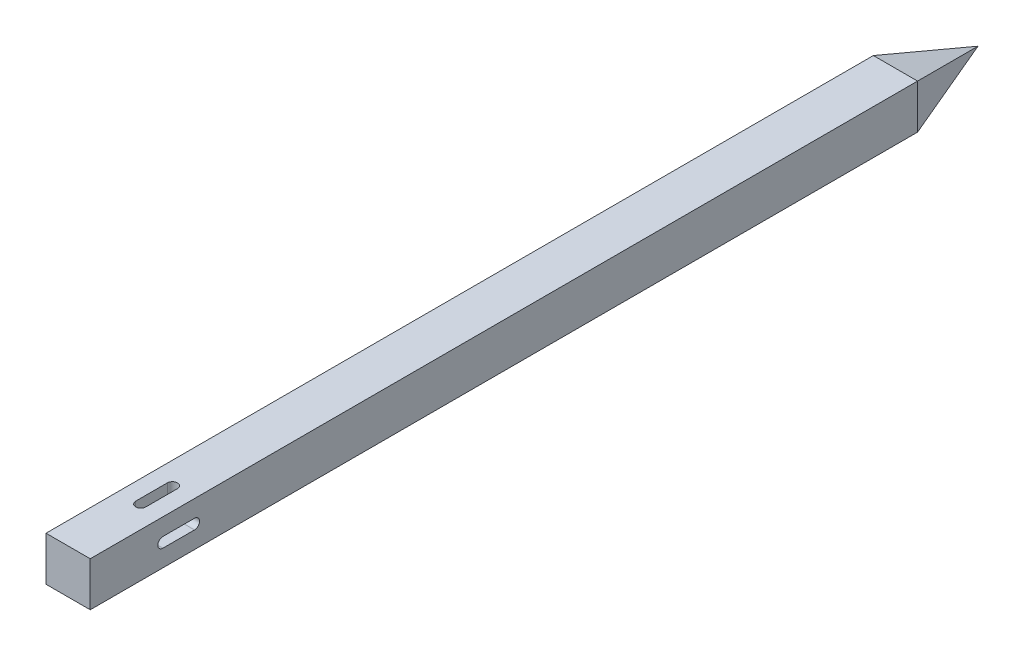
ISO-10303-21;
HEADER;
FILE_DESCRIPTION(('STEP AP214'),'2;1');
FILE_NAME('part.step','',(''),(''),'','','');
FILE_SCHEMA(('AUTOMOTIVE_DESIGN { 1 0 10303 214 1 1 1 1 }'));
ENDSEC;
DATA;
#1=APPLICATION_CONTEXT('core data for automotive mechanical design processes');
#2=APPLICATION_PROTOCOL_DEFINITION('international standard','automotive_design',2000,#1);
#3=PRODUCT_CONTEXT('',#1,'mechanical');
#4=PRODUCT('Part','Part','',(#3));
#5=PRODUCT_RELATED_PRODUCT_CATEGORY('part','',(#4));
#6=PRODUCT_DEFINITION_FORMATION('','',#4);
#7=PRODUCT_DEFINITION_CONTEXT('part definition',#1,'design');
#8=PRODUCT_DEFINITION('design','',#6,#7);
#9=PRODUCT_DEFINITION_SHAPE('','',#8);
#10=(LENGTH_UNIT() NAMED_UNIT(*) SI_UNIT(.MILLI.,.METRE.));
#11=(NAMED_UNIT(*) PLANE_ANGLE_UNIT() SI_UNIT($,.RADIAN.));
#12=(NAMED_UNIT(*) SI_UNIT($,.STERADIAN.) SOLID_ANGLE_UNIT());
#13=UNCERTAINTY_MEASURE_WITH_UNIT(LENGTH_MEASURE(1.E-05),#10,'distance_accuracy_value','');
#14=(GEOMETRIC_REPRESENTATION_CONTEXT(3) GLOBAL_UNCERTAINTY_ASSIGNED_CONTEXT((#13)) GLOBAL_UNIT_ASSIGNED_CONTEXT((#10,
#11,#12)) REPRESENTATION_CONTEXT('',''));
#15=CARTESIAN_POINT('',(0.,0.,0.));
#16=DIRECTION('',(0.,0.,1.));
#17=DIRECTION('',(1.,0.,0.));
#18=AXIS2_PLACEMENT_3D('',#15,#16,#17);
#19=CARTESIAN_POINT('',(-17.5000000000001,0.,487.5));
#20=DIRECTION('',(1.,0.,0.));
#21=DIRECTION('',(0.,1.,0.));
#22=AXIS2_PLACEMENT_3D('',#19,#20,#21);
#23=CYLINDRICAL_SURFACE('',#22,4.);
#24=CARTESIAN_POINT('',(0.,0.,487.5));
#25=DIRECTION('',(0.707106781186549,-0.707106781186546,0.));
#26=DIRECTION('',(0.707106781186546,0.707106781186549,0.));
#27=AXIS2_PLACEMENT_3D('',#24,#25,#26);
#28=ELLIPSE('',#27,5.65685424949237,4.);
#29=CARTESIAN_POINT('',(3.99999999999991,4.00000000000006,487.5));
#30=VERTEX_POINT('',#29);
#31=CARTESIAN_POINT('',(0.,0.,483.5));
#32=VERTEX_POINT('',#31);
#33=EDGE_CURVE('E225',#30,#32,#28,.F.);
#34=ORIENTED_EDGE('',*,*,#33,.T.);
#35=CARTESIAN_POINT('',(0.,0.,487.5));
#36=DIRECTION('',(0.707106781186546,0.707106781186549,0.));
#37=DIRECTION('',(0.707106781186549,-0.707106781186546,0.));
#38=AXIS2_PLACEMENT_3D('',#35,#36,#37);
#39=ELLIPSE('',#38,5.65685424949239,4.);
#40=CARTESIAN_POINT('',(3.99999999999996,-3.99999999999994,487.5));
#41=VERTEX_POINT('',#40);
#42=EDGE_CURVE('E234',#32,#41,#39,.F.);
#43=ORIENTED_EDGE('',*,*,#42,.T.);
#44=DIRECTION('',(1.,0.,0.));
#45=VECTOR('',#44,1.);
#46=CARTESIAN_POINT('',(-17.5000000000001,-3.99999999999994,487.5));
#47=LINE('',#46,#45);
#48=CARTESIAN_POINT('',(17.5,-3.99999999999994,487.5));
#49=VERTEX_POINT('',#48);
#50=EDGE_CURVE('E266',#41,#49,#47,.T.);
#51=ORIENTED_EDGE('',*,*,#50,.T.);
#52=CARTESIAN_POINT('',(17.5,0.,487.5));
#53=DIRECTION('',(1.,0.,0.));
#54=DIRECTION('',(0.,1.,0.));
#55=AXIS2_PLACEMENT_3D('',#52,#53,#54);
#56=CIRCLE('',#55,4.);
#57=CARTESIAN_POINT('',(17.5,4.00000000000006,487.5));
#58=VERTEX_POINT('',#57);
#59=EDGE_CURVE('E237',#49,#58,#56,.T.);
#60=ORIENTED_EDGE('',*,*,#59,.T.);
#61=DIRECTION('',(1.,0.,0.));
#62=VECTOR('',#61,1.);
#63=CARTESIAN_POINT('',(-17.5000000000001,4.00000000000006,487.5));
#64=LINE('',#63,#62);
#65=EDGE_CURVE('E251',#30,#58,#64,.T.);
#66=ORIENTED_EDGE('',*,*,#65,.F.);
#67=EDGE_LOOP('',(#34,#43,#51,#60,#66));
#68=FACE_BOUND('',#67,.T.);
#69=ADVANCED_FACE('F39',(#68),#23,.F.);
#70=CARTESIAN_POINT('',(-17.5000000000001,-3.99999999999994,487.5));
#71=DIRECTION('',(0.,-1.,0.));
#72=DIRECTION('',(1.,0.,0.));
#73=AXIS2_PLACEMENT_3D('',#70,#71,#72);
#74=PLANE('',#73);
#75=ORIENTED_EDGE('',*,*,#50,.F.);
#76=DIRECTION('',(0.,0.,1.));
#77=VECTOR('',#76,1.);
#78=CARTESIAN_POINT('',(3.99999999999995,-3.99999999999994,487.5));
#79=LINE('',#78,#77);
#80=CARTESIAN_POINT('',(3.99999999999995,-3.99999999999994,512.5));
#81=VERTEX_POINT('',#80);
#82=EDGE_CURVE('E222',#41,#81,#79,.T.);
#83=ORIENTED_EDGE('',*,*,#82,.T.);
#84=DIRECTION('',(1.,0.,0.));
#85=VECTOR('',#84,1.);
#86=CARTESIAN_POINT('',(-17.5000000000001,-3.99999999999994,512.5));
#87=LINE('',#86,#85);
#88=CARTESIAN_POINT('',(17.5,-3.99999999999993,512.5));
#89=VERTEX_POINT('',#88);
#90=EDGE_CURVE('E270',#81,#89,#87,.T.);
#91=ORIENTED_EDGE('',*,*,#90,.T.);
#92=DIRECTION('',(0.,0.,-1.));
#93=VECTOR('',#92,1.);
#94=CARTESIAN_POINT('',(17.5,-3.99999999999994,487.5));
#95=LINE('',#94,#93);
#96=EDGE_CURVE('E242',#89,#49,#95,.T.);
#97=ORIENTED_EDGE('',*,*,#96,.T.);
#98=EDGE_LOOP('',(#75,#83,#91,#97));
#99=FACE_BOUND('',#98,.T.);
#100=ADVANCED_FACE('F351',(#99),#74,.F.);
#101=CARTESIAN_POINT('',(-17.5000000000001,0.,512.5));
#102=DIRECTION('',(1.,0.,0.));
#103=DIRECTION('',(0.,1.,0.));
#104=AXIS2_PLACEMENT_3D('',#101,#102,#103);
#105=CYLINDRICAL_SURFACE('',#104,4.);
#106=ORIENTED_EDGE('',*,*,#90,.F.);
#107=CARTESIAN_POINT('',(0.,0.,512.5));
#108=DIRECTION('',(0.707106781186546,0.707106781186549,0.));
#109=DIRECTION('',(0.707106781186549,-0.707106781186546,0.));
#110=AXIS2_PLACEMENT_3D('',#107,#108,#109);
#111=ELLIPSE('',#110,5.65685424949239,4.);
#112=CARTESIAN_POINT('',(0.,0.,516.5));
#113=VERTEX_POINT('',#112);
#114=EDGE_CURVE('E219',#81,#113,#111,.F.);
#115=ORIENTED_EDGE('',*,*,#114,.T.);
#116=CARTESIAN_POINT('',(0.,0.,512.5));
#117=DIRECTION('',(0.707106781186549,-0.707106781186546,0.));
#118=DIRECTION('',(0.707106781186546,0.707106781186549,0.));
#119=AXIS2_PLACEMENT_3D('',#116,#117,#118);
#120=ELLIPSE('',#119,5.65685424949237,4.);
#121=CARTESIAN_POINT('',(3.99999999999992,4.00000000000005,512.5));
#122=VERTEX_POINT('',#121);
#123=EDGE_CURVE('E54',#113,#122,#120,.F.);
#124=ORIENTED_EDGE('',*,*,#123,.T.);
#125=DIRECTION('',(1.,0.,0.));
#126=VECTOR('',#125,1.);
#127=CARTESIAN_POINT('',(-17.5000000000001,4.00000000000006,512.5));
#128=LINE('',#127,#126);
#129=CARTESIAN_POINT('',(17.5,4.00000000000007,512.5));
#130=VERTEX_POINT('',#129);
#131=EDGE_CURVE('E274',#122,#130,#128,.T.);
#132=ORIENTED_EDGE('',*,*,#131,.T.);
#133=CARTESIAN_POINT('',(17.5,0.,512.5));
#134=DIRECTION('',(1.,0.,0.));
#135=DIRECTION('',(0.,1.,0.));
#136=AXIS2_PLACEMENT_3D('',#133,#134,#135);
#137=CIRCLE('',#136,4.);
#138=EDGE_CURVE('E257',#130,#89,#137,.T.);
#139=ORIENTED_EDGE('',*,*,#138,.T.);
#140=EDGE_LOOP('',(#106,#115,#124,#132,#139));
#141=FACE_BOUND('',#140,.T.);
#142=ADVANCED_FACE('F366',(#141),#105,.F.);
#143=CARTESIAN_POINT('',(-17.5000000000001,4.00000000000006,487.5));
#144=DIRECTION('',(0.,1.,0.));
#145=DIRECTION('',(-1.,0.,0.));
#146=AXIS2_PLACEMENT_3D('',#143,#144,#145);
#147=PLANE('',#146);
#148=ORIENTED_EDGE('',*,*,#131,.F.);
#149=DIRECTION('',(0.,0.,-1.));
#150=VECTOR('',#149,1.);
#151=CARTESIAN_POINT('',(3.99999999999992,4.00000000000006,487.5));
#152=LINE('',#151,#150);
#153=EDGE_CURVE('E11',#122,#30,#152,.T.);
#154=ORIENTED_EDGE('',*,*,#153,.T.);
#155=ORIENTED_EDGE('',*,*,#65,.T.);
#156=DIRECTION('',(0.,0.,1.));
#157=VECTOR('',#156,1.);
#158=CARTESIAN_POINT('',(17.5,4.00000000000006,487.5));
#159=LINE('',#158,#157);
#160=EDGE_CURVE('E254',#58,#130,#159,.T.);
#161=ORIENTED_EDGE('',*,*,#160,.T.);
#162=EDGE_LOOP('',(#148,#154,#155,#161));
#163=FACE_BOUND('',#162,.T.);
#164=ADVANCED_FACE('F362',(#163),#147,.F.);
#165=CARTESIAN_POINT('',(-17.5,-17.5,570.));
#166=DIRECTION('',(1.,0.,0.));
#167=DIRECTION('',(0.,0.,-1.));
#168=AXIS2_PLACEMENT_3D('',#165,#166,#167);
#169=PLANE('',#168);
#170=DIRECTION('',(0.,0.,-1.));
#171=VECTOR('',#170,1.);
#172=CARTESIAN_POINT('',(-17.5000000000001,-3.99999999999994,487.5));
#173=LINE('',#172,#171);
#174=CARTESIAN_POINT('',(-17.5000000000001,-3.99999999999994,512.5));
#175=VERTEX_POINT('',#174);
#176=CARTESIAN_POINT('',(-17.5000000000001,-3.99999999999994,487.5));
#177=VERTEX_POINT('',#176);
#178=EDGE_CURVE('E248',#175,#177,#173,.T.);
#179=ORIENTED_EDGE('',*,*,#178,.T.);
#180=CARTESIAN_POINT('',(-17.5000000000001,0.,487.5));
#181=DIRECTION('',(1.,0.,0.));
#182=DIRECTION('',(0.,1.,0.));
#183=AXIS2_PLACEMENT_3D('',#180,#181,#182);
#184=CIRCLE('',#183,4.);
#185=CARTESIAN_POINT('',(-17.5000000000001,4.00000000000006,487.5));
#186=VERTEX_POINT('',#185);
#187=EDGE_CURVE('E238',#177,#186,#184,.T.);
#188=ORIENTED_EDGE('',*,*,#187,.T.);
#189=DIRECTION('',(0.,0.,1.));
#190=VECTOR('',#189,1.);
#191=CARTESIAN_POINT('',(-17.5000000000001,4.00000000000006,487.5));
#192=LINE('',#191,#190);
#193=CARTESIAN_POINT('',(-17.5,4.00000000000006,512.5));
#194=VERTEX_POINT('',#193);
#195=EDGE_CURVE('E241',#186,#194,#192,.T.);
#196=ORIENTED_EDGE('',*,*,#195,.T.);
#197=CARTESIAN_POINT('',(-17.5000000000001,0.,512.5));
#198=DIRECTION('',(1.,0.,0.));
#199=DIRECTION('',(0.,1.,0.));
#200=AXIS2_PLACEMENT_3D('',#197,#198,#199);
#201=CIRCLE('',#200,4.);
#202=EDGE_CURVE('E245',#194,#175,#201,.T.);
#203=ORIENTED_EDGE('',*,*,#202,.T.);
#204=EDGE_LOOP('',(#179,#188,#196,#203));
#205=FACE_BOUND('',#204,.T.);
#206=DIRECTION('',(0.,0.,-1.));
#207=VECTOR('',#206,1.);
#208=CARTESIAN_POINT('',(-17.5,17.5,570.));
#209=LINE('',#208,#207);
#210=CARTESIAN_POINT('',(-17.5,17.5,570.));
#211=VERTEX_POINT('',#210);
#212=CARTESIAN_POINT('',(-17.5,17.5,-84.6891108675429));
#213=VERTEX_POINT('',#212);
#214=EDGE_CURVE('E303',#211,#213,#209,.T.);
#215=ORIENTED_EDGE('',*,*,#214,.T.);
#216=DIRECTION('',(0.,-1.,0.));
#217=VECTOR('',#216,1.);
#218=CARTESIAN_POINT('',(-17.5000000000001,17.4999999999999,-84.6891108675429));
#219=LINE('',#218,#217);
#220=CARTESIAN_POINT('',(-17.4999999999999,-17.5000000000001,-84.6891108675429));
#221=VERTEX_POINT('',#220);
#222=EDGE_CURVE('E288',#213,#221,#219,.T.);
#223=ORIENTED_EDGE('',*,*,#222,.T.);
#224=DIRECTION('',(0.,0.,-1.));
#225=VECTOR('',#224,1.);
#226=CARTESIAN_POINT('',(-17.5,-17.5,570.));
#227=LINE('',#226,#225);
#228=CARTESIAN_POINT('',(-17.5,-17.5,570.));
#229=VERTEX_POINT('',#228);
#230=EDGE_CURVE('E312',#229,#221,#227,.T.);
#231=ORIENTED_EDGE('',*,*,#230,.F.);
#232=DIRECTION('',(0.,-1.,0.));
#233=VECTOR('',#232,1.);
#234=CARTESIAN_POINT('',(-17.5,-17.5,570.));
#235=LINE('',#234,#233);
#236=EDGE_CURVE('E294',#211,#229,#235,.T.);
#237=ORIENTED_EDGE('',*,*,#236,.F.);
#238=EDGE_LOOP('',(#215,#223,#231,#237));
#239=FACE_BOUND('',#238,.T.);
#240=ADVANCED_FACE('F41',(#205,#239),#169,.F.);
#241=CARTESIAN_POINT('',(-17.5,-17.5,570.));
#242=DIRECTION('',(0.,1.,0.));
#243=DIRECTION('',(0.,0.,1.));
#244=AXIS2_PLACEMENT_3D('',#241,#242,#243);
#245=PLANE('',#244);
#246=DIRECTION('',(0.,0.,-1.));
#247=VECTOR('',#246,1.);
#248=CARTESIAN_POINT('',(4.00000000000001,-17.5,487.5));
#249=LINE('',#248,#247);
#250=CARTESIAN_POINT('',(4.,-17.5,512.5));
#251=VERTEX_POINT('',#250);
#252=CARTESIAN_POINT('',(4.00000000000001,-17.5,487.5));
#253=VERTEX_POINT('',#252);
#254=EDGE_CURVE('E203',#251,#253,#249,.T.);
#255=ORIENTED_EDGE('',*,*,#254,.T.);
#256=CARTESIAN_POINT('',(0.,-17.5000000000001,487.5));
#257=DIRECTION('',(0.,1.,0.));
#258=DIRECTION('',(-1.,0.,0.));
#259=AXIS2_PLACEMENT_3D('',#256,#257,#258);
#260=CIRCLE('',#259,4.);
#261=CARTESIAN_POINT('',(-3.99999999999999,-17.5000000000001,487.5));
#262=VERTEX_POINT('',#261);
#263=EDGE_CURVE('E208',#253,#262,#260,.T.);
#264=ORIENTED_EDGE('',*,*,#263,.T.);
#265=DIRECTION('',(0.,0.,1.));
#266=VECTOR('',#265,1.);
#267=CARTESIAN_POINT('',(-3.99999999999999,-17.5000000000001,487.5));
#268=LINE('',#267,#266);
#269=CARTESIAN_POINT('',(-4.,-17.5,512.5));
#270=VERTEX_POINT('',#269);
#271=EDGE_CURVE('E173',#262,#270,#268,.T.);
#272=ORIENTED_EDGE('',*,*,#271,.T.);
#273=CARTESIAN_POINT('',(0.,-17.5000000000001,512.5));
#274=DIRECTION('',(0.,1.,0.));
#275=DIRECTION('',(-1.,0.,0.));
#276=AXIS2_PLACEMENT_3D('',#273,#274,#275);
#277=CIRCLE('',#276,4.);
#278=EDGE_CURVE('E62',#270,#251,#277,.T.);
#279=ORIENTED_EDGE('',*,*,#278,.T.);
#280=EDGE_LOOP('',(#255,#264,#272,#279));
#281=FACE_BOUND('',#280,.T.);
#282=ORIENTED_EDGE('',*,*,#230,.T.);
#283=DIRECTION('',(1.,0.,0.));
#284=VECTOR('',#283,1.);
#285=CARTESIAN_POINT('',(-17.5,-17.5,-84.6891108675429));
#286=LINE('',#285,#284);
#287=CARTESIAN_POINT('',(17.5000000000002,-17.4999999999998,-84.6891108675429));
#288=VERTEX_POINT('',#287);
#289=EDGE_CURVE('E280',#221,#288,#286,.T.);
#290=ORIENTED_EDGE('',*,*,#289,.T.);
#291=DIRECTION('',(0.,0.,-1.));
#292=VECTOR('',#291,1.);
#293=CARTESIAN_POINT('',(17.5,-17.5,570.));
#294=LINE('',#293,#292);
#295=CARTESIAN_POINT('',(17.5,-17.5,570.));
#296=VERTEX_POINT('',#295);
#297=EDGE_CURVE('E309',#296,#288,#294,.T.);
#298=ORIENTED_EDGE('',*,*,#297,.F.);
#299=DIRECTION('',(1.,0.,0.));
#300=VECTOR('',#299,1.);
#301=CARTESIAN_POINT('',(-17.5,-17.5,570.));
#302=LINE('',#301,#300);
#303=EDGE_CURVE('E297',#229,#296,#302,.T.);
#304=ORIENTED_EDGE('',*,*,#303,.F.);
#305=EDGE_LOOP('',(#282,#290,#298,#304));
#306=FACE_BOUND('',#305,.T.);
#307=ADVANCED_FACE('F339',(#281,#306),#245,.F.);
#308=CARTESIAN_POINT('',(17.5,-17.5,570.));
#309=DIRECTION('',(-1.,0.,0.));
#310=DIRECTION('',(0.,-1.,0.));
#311=AXIS2_PLACEMENT_3D('',#308,#309,#310);
#312=PLANE('',#311);
#313=ORIENTED_EDGE('',*,*,#160,.F.);
#314=ORIENTED_EDGE('',*,*,#59,.F.);
#315=ORIENTED_EDGE('',*,*,#96,.F.);
#316=ORIENTED_EDGE('',*,*,#138,.F.);
#317=EDGE_LOOP('',(#313,#314,#315,#316));
#318=FACE_BOUND('',#317,.T.);
#319=ORIENTED_EDGE('',*,*,#297,.T.);
#320=DIRECTION('',(0.,1.,0.));
#321=VECTOR('',#320,1.);
#322=CARTESIAN_POINT('',(17.5000000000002,-17.4999999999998,-84.6891108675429));
#323=LINE('',#322,#321);
#324=CARTESIAN_POINT('',(17.4999999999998,17.5000000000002,-84.6891108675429));
#325=VERTEX_POINT('',#324);
#326=EDGE_CURVE('E265',#288,#325,#323,.T.);
#327=ORIENTED_EDGE('',*,*,#326,.T.);
#328=DIRECTION('',(0.,0.,-1.));
#329=VECTOR('',#328,1.);
#330=CARTESIAN_POINT('',(17.5,17.5,570.));
#331=LINE('',#330,#329);
#332=CARTESIAN_POINT('',(17.5,17.5,570.));
#333=VERTEX_POINT('',#332);
#334=EDGE_CURVE('E306',#333,#325,#331,.T.);
#335=ORIENTED_EDGE('',*,*,#334,.F.);
#336=DIRECTION('',(0.,1.,0.));
#337=VECTOR('',#336,1.);
#338=CARTESIAN_POINT('',(17.5,-17.5,570.));
#339=LINE('',#338,#337);
#340=EDGE_CURVE('E299',#296,#333,#339,.T.);
#341=ORIENTED_EDGE('',*,*,#340,.F.);
#342=EDGE_LOOP('',(#319,#327,#335,#341));
#343=FACE_BOUND('',#342,.T.);
#344=ADVANCED_FACE('F358',(#318,#343),#312,.F.);
#345=CARTESIAN_POINT('',(-17.5,17.5,570.));
#346=DIRECTION('',(0.,-1.,0.));
#347=DIRECTION('',(0.,0.,-1.));
#348=AXIS2_PLACEMENT_3D('',#345,#346,#347);
#349=PLANE('',#348);
#350=DIRECTION('',(0.,0.,1.));
#351=VECTOR('',#350,1.);
#352=CARTESIAN_POINT('',(-4.00000000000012,17.5,487.5));
#353=LINE('',#352,#351);
#354=CARTESIAN_POINT('',(-4.00000000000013,17.5,487.5));
#355=VERTEX_POINT('',#354);
#356=CARTESIAN_POINT('',(-4.00000000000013,17.5,512.5));
#357=VERTEX_POINT('',#356);
#358=EDGE_CURVE('E177',#355,#357,#353,.T.);
#359=ORIENTED_EDGE('',*,*,#358,.F.);
#360=CARTESIAN_POINT('',(-1.29476650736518E-13,17.5,487.5));
#361=DIRECTION('',(0.,1.,0.));
#362=DIRECTION('',(-1.,0.,0.));
#363=AXIS2_PLACEMENT_3D('',#360,#361,#362);
#364=CIRCLE('',#363,4.);
#365=CARTESIAN_POINT('',(3.99999999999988,17.5,487.5));
#366=VERTEX_POINT('',#365);
#367=EDGE_CURVE('E206',#366,#355,#364,.T.);
#368=ORIENTED_EDGE('',*,*,#367,.F.);
#369=DIRECTION('',(0.,0.,-1.));
#370=VECTOR('',#369,1.);
#371=CARTESIAN_POINT('',(3.99999999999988,17.5,487.5));
#372=LINE('',#371,#370);
#373=CARTESIAN_POINT('',(3.99999999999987,17.5,512.5));
#374=VERTEX_POINT('',#373);
#375=EDGE_CURVE('E187',#374,#366,#372,.T.);
#376=ORIENTED_EDGE('',*,*,#375,.F.);
#377=CARTESIAN_POINT('',(-1.34069076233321E-13,17.5,512.5));
#378=DIRECTION('',(0.,1.,0.));
#379=DIRECTION('',(-1.,0.,0.));
#380=AXIS2_PLACEMENT_3D('',#377,#378,#379);
#381=CIRCLE('',#380,4.);
#382=EDGE_CURVE('E166',#357,#374,#381,.T.);
#383=ORIENTED_EDGE('',*,*,#382,.F.);
#384=EDGE_LOOP('',(#359,#368,#376,#383));
#385=FACE_BOUND('',#384,.T.);
#386=ORIENTED_EDGE('',*,*,#334,.T.);
#387=DIRECTION('',(-1.,0.,0.));
#388=VECTOR('',#387,1.);
#389=CARTESIAN_POINT('',(17.5,17.5,-84.6891108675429));
#390=LINE('',#389,#388);
#391=EDGE_CURVE('E291',#325,#213,#390,.T.);
#392=ORIENTED_EDGE('',*,*,#391,.T.);
#393=ORIENTED_EDGE('',*,*,#214,.F.);
#394=DIRECTION('',(-1.,0.,0.));
#395=VECTOR('',#394,1.);
#396=CARTESIAN_POINT('',(-17.5,17.5,570.));
#397=LINE('',#396,#395);
#398=EDGE_CURVE('E301',#333,#211,#397,.T.);
#399=ORIENTED_EDGE('',*,*,#398,.F.);
#400=EDGE_LOOP('',(#386,#392,#393,#399));
#401=FACE_BOUND('',#400,.T.);
#402=ADVANCED_FACE('F184',(#385,#401),#349,.F.);
#403=CARTESIAN_POINT('',(0.,0.,570.));
#404=DIRECTION('',(0.,0.,-1.));
#405=DIRECTION('',(-1.,0.,0.));
#406=AXIS2_PLACEMENT_3D('',#403,#404,#405);
#407=PLANE('',#406);
#408=ORIENTED_EDGE('',*,*,#236,.T.);
#409=ORIENTED_EDGE('',*,*,#303,.T.);
#410=ORIENTED_EDGE('',*,*,#340,.T.);
#411=ORIENTED_EDGE('',*,*,#398,.T.);
#412=EDGE_LOOP('',(#408,#409,#410,#411));
#413=FACE_BOUND('',#412,.T.);
#414=ADVANCED_FACE('F412',(#413),#407,.F.);
#415=CARTESIAN_POINT('',(17.5,0.,-150.));
#416=DIRECTION('',(0.,-0.96592582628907,0.258819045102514));
#417=DIRECTION('',(0.,-0.258819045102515,-0.96592582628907));
#418=AXIS2_PLACEMENT_3D('',#415,#416,#417);
#419=PLANE('',#418);
#420=ORIENTED_EDGE('',*,*,#391,.F.);
#421=DIRECTION('',(-0.250562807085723,-0.250562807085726,-0.935113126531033));
#422=VECTOR('',#421,1.);
#423=CARTESIAN_POINT('',(1.09868010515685,1.09868010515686,-145.899670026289));
#424=LINE('',#423,#422);
#425=CARTESIAN_POINT('',(0.,0.,-150.));
#426=VERTEX_POINT('',#425);
#427=EDGE_CURVE('E285',#325,#426,#424,.T.);
#428=ORIENTED_EDGE('',*,*,#427,.T.);
#429=DIRECTION('',(-0.250562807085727,0.250562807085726,0.935113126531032));
#430=VECTOR('',#429,1.);
#431=CARTESIAN_POINT('',(1.09868010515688,-1.09868010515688,-154.100329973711));
#432=LINE('',#431,#430);
#433=EDGE_CURVE('E315',#426,#213,#432,.T.);
#434=ORIENTED_EDGE('',*,*,#433,.T.);
#435=EDGE_LOOP('',(#420,#428,#434));
#436=FACE_BOUND('',#435,.T.);
#437=ADVANCED_FACE('F408',(#436),#419,.F.);
#438=CARTESIAN_POINT('',(0.,17.5,-150.));
#439=DIRECTION('',(0.96592582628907,0.,0.258819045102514));
#440=DIRECTION('',(0.258819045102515,0.,-0.96592582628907));
#441=AXIS2_PLACEMENT_3D('',#438,#439,#440);
#442=PLANE('',#441);
#443=ORIENTED_EDGE('',*,*,#433,.F.);
#444=DIRECTION('',(-0.250562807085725,-0.250562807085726,0.935113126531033));
#445=VECTOR('',#444,1.);
#446=CARTESIAN_POINT('',(1.09868010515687,1.09868010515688,-154.100329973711));
#447=LINE('',#446,#445);
#448=EDGE_CURVE('E318',#426,#221,#447,.T.);
#449=ORIENTED_EDGE('',*,*,#448,.T.);
#450=ORIENTED_EDGE('',*,*,#222,.F.);
#451=EDGE_LOOP('',(#443,#449,#450));
#452=FACE_BOUND('',#451,.T.);
#453=ADVANCED_FACE('F401',(#452),#442,.F.);
#454=CARTESIAN_POINT('',(-17.5,0.,-150.));
#455=DIRECTION('',(0.,0.96592582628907,0.258819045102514));
#456=DIRECTION('',(0.,0.258819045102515,-0.96592582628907));
#457=AXIS2_PLACEMENT_3D('',#454,#455,#456);
#458=PLANE('',#457);
#459=DIRECTION('',(0.250562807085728,-0.250562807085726,0.935113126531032));
#460=VECTOR('',#459,1.);
#461=CARTESIAN_POINT('',(-1.0986801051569,1.09868010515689,-154.100329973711));
#462=LINE('',#461,#460);
#463=EDGE_CURVE('E283',#426,#288,#462,.T.);
#464=ORIENTED_EDGE('',*,*,#463,.T.);
#465=ORIENTED_EDGE('',*,*,#289,.F.);
#466=ORIENTED_EDGE('',*,*,#448,.F.);
#467=EDGE_LOOP('',(#464,#465,#466));
#468=FACE_BOUND('',#467,.T.);
#469=ADVANCED_FACE('F396',(#468),#458,.F.);
#470=CARTESIAN_POINT('',(1.83302770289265E-13,-17.5,-150.));
#471=DIRECTION('',(-0.96592582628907,0.,0.258819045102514));
#472=DIRECTION('',(-0.258819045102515,0.,-0.96592582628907));
#473=AXIS2_PLACEMENT_3D('',#470,#471,#472);
#474=PLANE('',#473);
#475=ORIENTED_EDGE('',*,*,#326,.F.);
#476=ORIENTED_EDGE('',*,*,#463,.F.);
#477=ORIENTED_EDGE('',*,*,#427,.F.);
#478=EDGE_LOOP('',(#475,#476,#477));
#479=FACE_BOUND('',#478,.T.);
#480=ADVANCED_FACE('F390',(#479),#474,.F.);
#481=CARTESIAN_POINT('',(0.,0.,487.5));
#482=DIRECTION('',(0.707106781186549,-0.707106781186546,0.));
#483=DIRECTION('',(0.707106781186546,0.707106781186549,0.));
#484=AXIS2_PLACEMENT_3D('',#481,#482,#483);
#485=ELLIPSE('',#484,5.65685424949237,4.);
#486=CARTESIAN_POINT('',(-4.00000000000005,-3.99999999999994,487.5));
#487=VERTEX_POINT('',#486);
#488=EDGE_CURVE('E228',#487,#32,#485,.T.);
#489=ORIENTED_EDGE('',*,*,#488,.T.);
#490=CARTESIAN_POINT('',(0.,0.,487.5));
#491=DIRECTION('',(0.707106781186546,0.707106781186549,0.));
#492=DIRECTION('',(0.707106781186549,-0.707106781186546,0.));
#493=AXIS2_PLACEMENT_3D('',#490,#491,#492);
#494=ELLIPSE('',#493,5.65685424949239,4.);
#495=CARTESIAN_POINT('',(-4.00000000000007,4.00000000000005,487.5));
#496=VERTEX_POINT('',#495);
#497=EDGE_CURVE('E231',#32,#496,#494,.T.);
#498=ORIENTED_EDGE('',*,*,#497,.T.);
#499=EDGE_CURVE('E275',#186,#496,#64,.T.);
#500=ORIENTED_EDGE('',*,*,#499,.F.);
#501=ORIENTED_EDGE('',*,*,#187,.F.);
#502=EDGE_CURVE('E262',#177,#487,#47,.T.);
#503=ORIENTED_EDGE('',*,*,#502,.T.);
#504=EDGE_LOOP('',(#489,#498,#500,#501,#503));
#505=FACE_BOUND('',#504,.T.);
#506=ADVANCED_FACE('F331',(#505),#23,.F.);
#507=CARTESIAN_POINT('',(-4.00000000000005,-3.99999999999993,512.5));
#508=VERTEX_POINT('',#507);
#509=EDGE_CURVE('E267',#175,#508,#87,.T.);
#510=ORIENTED_EDGE('',*,*,#509,.T.);
#511=DIRECTION('',(0.,0.,-1.));
#512=VECTOR('',#511,1.);
#513=CARTESIAN_POINT('',(-4.00000000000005,-3.99999999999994,487.5));
#514=LINE('',#513,#512);
#515=EDGE_CURVE('E211',#508,#487,#514,.T.);
#516=ORIENTED_EDGE('',*,*,#515,.T.);
#517=ORIENTED_EDGE('',*,*,#502,.F.);
#518=ORIENTED_EDGE('',*,*,#178,.F.);
#519=EDGE_LOOP('',(#510,#516,#517,#518));
#520=FACE_BOUND('',#519,.T.);
#521=ADVANCED_FACE('F386',(#520),#74,.F.);
#522=CARTESIAN_POINT('',(-4.00000000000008,4.00000000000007,512.5));
#523=VERTEX_POINT('',#522);
#524=EDGE_CURVE('E271',#194,#523,#128,.T.);
#525=ORIENTED_EDGE('',*,*,#524,.T.);
#526=CARTESIAN_POINT('',(0.,0.,512.5));
#527=DIRECTION('',(0.707106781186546,0.707106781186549,0.));
#528=DIRECTION('',(0.707106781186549,-0.707106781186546,0.));
#529=AXIS2_PLACEMENT_3D('',#526,#527,#528);
#530=ELLIPSE('',#529,5.65685424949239,4.);
#531=EDGE_CURVE('E169',#523,#113,#530,.T.);
#532=ORIENTED_EDGE('',*,*,#531,.T.);
#533=CARTESIAN_POINT('',(0.,0.,512.5));
#534=DIRECTION('',(0.707106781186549,-0.707106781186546,0.));
#535=DIRECTION('',(0.707106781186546,0.707106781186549,0.));
#536=AXIS2_PLACEMENT_3D('',#533,#534,#535);
#537=ELLIPSE('',#536,5.65685424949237,4.);
#538=EDGE_CURVE('E215',#113,#508,#537,.T.);
#539=ORIENTED_EDGE('',*,*,#538,.T.);
#540=ORIENTED_EDGE('',*,*,#509,.F.);
#541=ORIENTED_EDGE('',*,*,#202,.F.);
#542=EDGE_LOOP('',(#525,#532,#539,#540,#541));
#543=FACE_BOUND('',#542,.T.);
#544=ADVANCED_FACE('F325',(#543),#105,.F.);
#545=ORIENTED_EDGE('',*,*,#499,.T.);
#546=DIRECTION('',(0.,0.,1.));
#547=VECTOR('',#546,1.);
#548=CARTESIAN_POINT('',(-4.00000000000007,4.00000000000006,487.5));
#549=LINE('',#548,#547);
#550=EDGE_CURVE('E47',#496,#523,#549,.T.);
#551=ORIENTED_EDGE('',*,*,#550,.T.);
#552=ORIENTED_EDGE('',*,*,#524,.F.);
#553=ORIENTED_EDGE('',*,*,#195,.F.);
#554=EDGE_LOOP('',(#545,#551,#552,#553));
#555=FACE_BOUND('',#554,.T.);
#556=ADVANCED_FACE('F322',(#555),#147,.F.);
#557=CARTESIAN_POINT('',(4.00000000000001,-17.5,487.5));
#558=DIRECTION('',(1.,0.,0.));
#559=DIRECTION('',(0.,1.,0.));
#560=AXIS2_PLACEMENT_3D('',#557,#558,#559);
#561=PLANE('',#560);
#562=DIRECTION('',(0.,1.,0.));
#563=VECTOR('',#562,1.);
#564=CARTESIAN_POINT('',(4.,-17.5,512.5));
#565=LINE('',#564,#563);
#566=EDGE_CURVE('E188',#122,#374,#565,.T.);
#567=ORIENTED_EDGE('',*,*,#566,.T.);
#568=ORIENTED_EDGE('',*,*,#375,.T.);
#569=DIRECTION('',(0.,1.,0.));
#570=VECTOR('',#569,1.);
#571=CARTESIAN_POINT('',(4.00000000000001,-17.5,487.5));
#572=LINE('',#571,#570);
#573=EDGE_CURVE('E199',#30,#366,#572,.T.);
#574=ORIENTED_EDGE('',*,*,#573,.F.);
#575=ORIENTED_EDGE('',*,*,#153,.F.);
#576=EDGE_LOOP('',(#567,#568,#574,#575));
#577=FACE_BOUND('',#576,.T.);
#578=ADVANCED_FACE('F364',(#577),#561,.F.);
#579=CARTESIAN_POINT('',(-3.99999999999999,-17.5000000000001,487.5));
#580=DIRECTION('',(-1.,0.,0.));
#581=DIRECTION('',(0.,-1.,0.));
#582=AXIS2_PLACEMENT_3D('',#579,#580,#581);
#583=PLANE('',#582);
#584=DIRECTION('',(0.,1.,0.));
#585=VECTOR('',#584,1.);
#586=CARTESIAN_POINT('',(-3.99999999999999,-17.5000000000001,487.5));
#587=LINE('',#586,#585);
#588=EDGE_CURVE('E180',#496,#355,#587,.T.);
#589=ORIENTED_EDGE('',*,*,#588,.T.);
#590=ORIENTED_EDGE('',*,*,#358,.T.);
#591=DIRECTION('',(0.,1.,0.));
#592=VECTOR('',#591,1.);
#593=CARTESIAN_POINT('',(-4.,-17.5000000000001,512.5));
#594=LINE('',#593,#592);
#595=EDGE_CURVE('E162',#523,#357,#594,.T.);
#596=ORIENTED_EDGE('',*,*,#595,.F.);
#597=ORIENTED_EDGE('',*,*,#550,.F.);
#598=EDGE_LOOP('',(#589,#590,#596,#597));
#599=FACE_BOUND('',#598,.T.);
#600=ADVANCED_FACE('F178',(#599),#583,.F.);
#601=CARTESIAN_POINT('',(0.,-17.5000000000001,512.5));
#602=DIRECTION('',(0.,1.,0.));
#603=DIRECTION('',(-1.,0.,0.));
#604=AXIS2_PLACEMENT_3D('',#601,#602,#603);
#605=CYLINDRICAL_SURFACE('',#604,4.);
#606=ORIENTED_EDGE('',*,*,#595,.T.);
#607=ORIENTED_EDGE('',*,*,#382,.T.);
#608=ORIENTED_EDGE('',*,*,#566,.F.);
#609=ORIENTED_EDGE('',*,*,#123,.F.);
#610=ORIENTED_EDGE('',*,*,#531,.F.);
#611=EDGE_LOOP('',(#606,#607,#608,#609,#610));
#612=FACE_BOUND('',#611,.T.);
#613=ADVANCED_FACE('F164',(#612),#605,.F.);
#614=CARTESIAN_POINT('',(0.,-17.5000000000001,487.5));
#615=DIRECTION('',(0.,1.,0.));
#616=DIRECTION('',(-1.,0.,0.));
#617=AXIS2_PLACEMENT_3D('',#614,#615,#616);
#618=CYLINDRICAL_SURFACE('',#617,4.);
#619=ORIENTED_EDGE('',*,*,#33,.F.);
#620=ORIENTED_EDGE('',*,*,#573,.T.);
#621=ORIENTED_EDGE('',*,*,#367,.T.);
#622=ORIENTED_EDGE('',*,*,#588,.F.);
#623=ORIENTED_EDGE('',*,*,#497,.F.);
#624=EDGE_LOOP('',(#619,#620,#621,#622,#623));
#625=FACE_BOUND('',#624,.T.);
#626=ADVANCED_FACE('F335',(#625),#618,.F.);
#627=ORIENTED_EDGE('',*,*,#488,.F.);
#628=EDGE_CURVE('E189',#262,#487,#587,.T.);
#629=ORIENTED_EDGE('',*,*,#628,.F.);
#630=ORIENTED_EDGE('',*,*,#263,.F.);
#631=EDGE_CURVE('E200',#253,#41,#572,.T.);
#632=ORIENTED_EDGE('',*,*,#631,.T.);
#633=ORIENTED_EDGE('',*,*,#42,.F.);
#634=EDGE_LOOP('',(#627,#629,#630,#632,#633));
#635=FACE_BOUND('',#634,.T.);
#636=ADVANCED_FACE('F346',(#635),#618,.F.);
#637=ORIENTED_EDGE('',*,*,#631,.F.);
#638=ORIENTED_EDGE('',*,*,#254,.F.);
#639=EDGE_CURVE('E191',#251,#81,#565,.T.);
#640=ORIENTED_EDGE('',*,*,#639,.T.);
#641=ORIENTED_EDGE('',*,*,#82,.F.);
#642=EDGE_LOOP('',(#637,#638,#640,#641));
#643=FACE_BOUND('',#642,.T.);
#644=ADVANCED_FACE('F370',(#643),#561,.F.);
#645=ORIENTED_EDGE('',*,*,#639,.F.);
#646=ORIENTED_EDGE('',*,*,#278,.F.);
#647=EDGE_CURVE('E172',#270,#508,#594,.T.);
#648=ORIENTED_EDGE('',*,*,#647,.T.);
#649=ORIENTED_EDGE('',*,*,#538,.F.);
#650=ORIENTED_EDGE('',*,*,#114,.F.);
#651=EDGE_LOOP('',(#645,#646,#648,#649,#650));
#652=FACE_BOUND('',#651,.T.);
#653=ADVANCED_FACE('F367',(#652),#605,.F.);
#654=ORIENTED_EDGE('',*,*,#647,.F.);
#655=ORIENTED_EDGE('',*,*,#271,.F.);
#656=ORIENTED_EDGE('',*,*,#628,.T.);
#657=ORIENTED_EDGE('',*,*,#515,.F.);
#658=EDGE_LOOP('',(#654,#655,#656,#657));
#659=FACE_BOUND('',#658,.T.);
#660=ADVANCED_FACE('F344',(#659),#583,.F.);
#661=CLOSED_SHELL('',(#69,#100,#142,#164,#240,#307,#344,#402,#414,#437,#453,#469,#480,#506,#521,
#544,#556,#578,#600,#613,#626,#636,#644,#653,#660));
#662=MANIFOLD_SOLID_BREP('B2',#661);
#663=ADVANCED_BREP_SHAPE_REPRESENTATION('',(#18,#662),#14);
#664=SHAPE_DEFINITION_REPRESENTATION(#9,#663);
ENDSEC;
END-ISO-10303-21;
